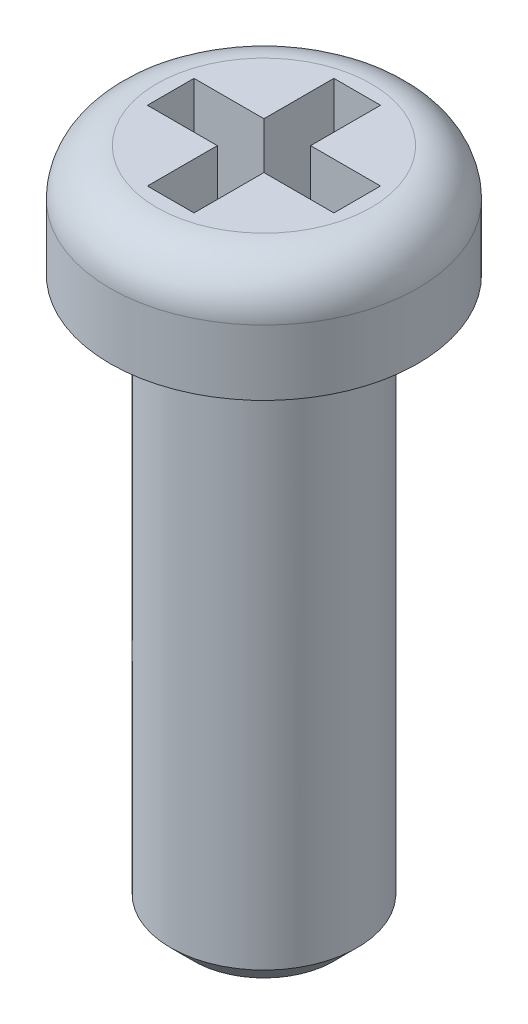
from build123d import *

# Parameters (mm, degrees)
SKETCH2_W               = 0.5
SKETCH2_H               = 2
CUT_EXTRUDE_THIN2_DEPTH = 1
CIRPATTERN1_COUNT       = 2
CIRPATTERN1_ANGLE       = 90
SKETCH3_R               = 1
BOSS_EXTRUDE1_DEPTH     = 6
FILLET1_R               = 0.2
CHAMFER1_SIZE           = 0.25


with BuildPart() as part:
    # Sketch1 → Base-Revolve (revolve)
    with BuildSketch(Plane.XY, mode=Mode.PRIVATE) as base_revolve_sk:
        with BuildLine():
            Line((1.65, 0), (0, 0))
            Line((0, 0), (0, 1.2))
            Line((0, 1.2), (1.15, 1.2))
            ThreePointArc((1.15, 1.2), (1.503553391, 1.053553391), (1.65, 0.7))
            Line((1.65, 0.7), (1.65, 0))
        make_face()
    revolve(base_revolve_sk.sketch.rotate(Axis((0, 11.592517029, 0), (0, -1, 0)), 90), axis=Axis((0, 11.592517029, 0), (0, -1, 0)))

    # Sketch2 → Cut-Extrude-Thin2 (cut)
    with BuildSketch(Plane(origin=(0, 1.2, 0), x_dir=(-1, 0, 0), z_dir=(0, 1, 0))):
        Rectangle(SKETCH2_W, SKETCH2_H)
    cut_extrude_thin2 = extrude(amount=-CUT_EXTRUDE_THIN2_DEPTH, mode=Mode.SUBTRACT)

    # CirPattern1: Cut-Extrude-Thin2 ×2 about axis
    cirpattern1_axis = Axis((0, 0, 0), (0, 1, 0))
    for i in range(1, CIRPATTERN1_COUNT):
        add(cut_extrude_thin2.rotate(cirpattern1_axis, i * CIRPATTERN1_ANGLE / (CIRPATTERN1_COUNT - 1)), mode=Mode.SUBTRACT)

    # Sketch3 → Boss-Extrude1 (add)
    with BuildSketch(Plane.XZ):
        with Locations(Location((0, 0, 0), (0, 0, 90))):
            Circle(SKETCH3_R)
    extrude(amount=BOSS_EXTRUDE1_DEPTH)

    # Fillet1
    fillet1_edges = [part.edges().sort_by_distance(p)[0] for p in [
        (0, 0, -1),
    ]]
    fillet(fillet1_edges, radius=FILLET1_R)

    # Chamfer1
    chamfer1_edges = [part.edges().sort_by_distance(p)[0] for p in [
        (0, -6, -1),
    ]]
    chamfer(chamfer1_edges, length=CHAMFER1_SIZE)


solid = part.part
